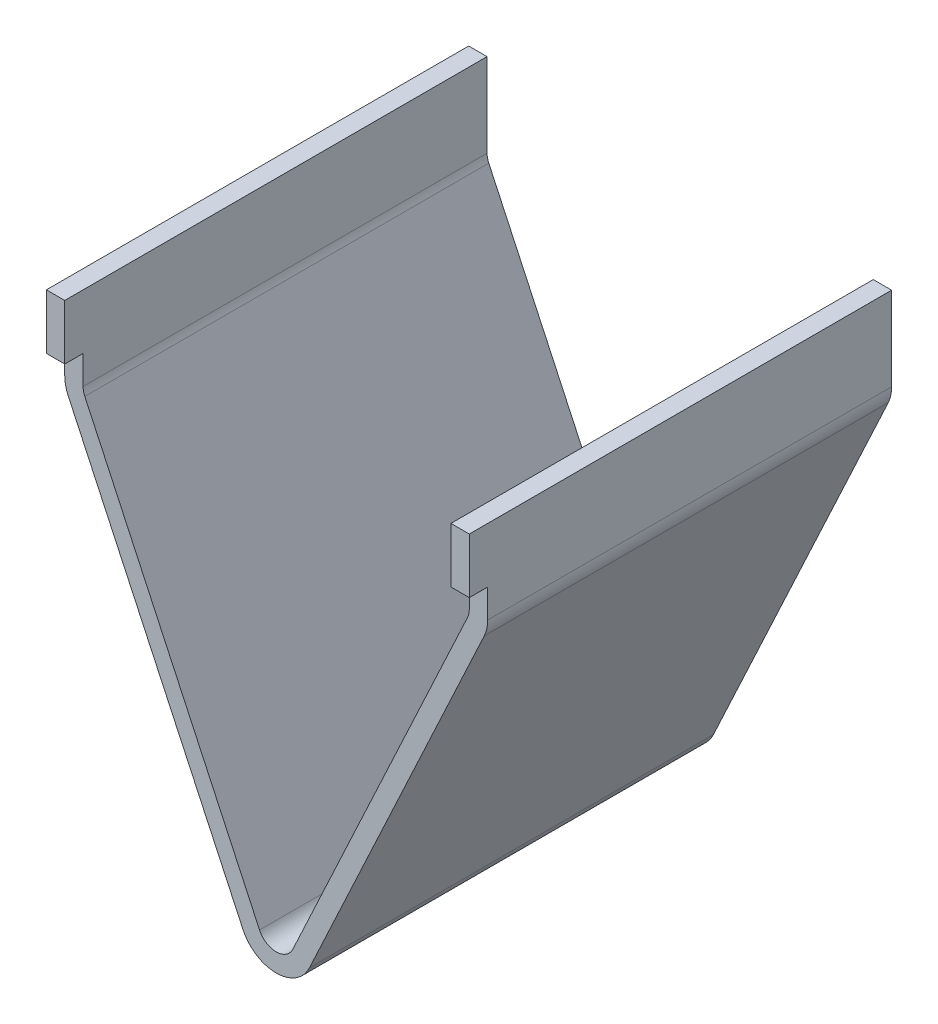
ISO-10303-21;
HEADER;
FILE_DESCRIPTION(('STEP AP214'),'2;1');
FILE_NAME('part.step','',(''),(''),'','','');
FILE_SCHEMA(('AUTOMOTIVE_DESIGN { 1 0 10303 214 1 1 1 1 }'));
ENDSEC;
DATA;
#1=APPLICATION_CONTEXT('core data for automotive mechanical design processes');
#2=APPLICATION_PROTOCOL_DEFINITION('international standard','automotive_design',2000,#1);
#3=PRODUCT_CONTEXT('',#1,'mechanical');
#4=PRODUCT('Part','Part','',(#3));
#5=PRODUCT_RELATED_PRODUCT_CATEGORY('part','',(#4));
#6=PRODUCT_DEFINITION_FORMATION('','',#4);
#7=PRODUCT_DEFINITION_CONTEXT('part definition',#1,'design');
#8=PRODUCT_DEFINITION('design','',#6,#7);
#9=PRODUCT_DEFINITION_SHAPE('','',#8);
#10=(LENGTH_UNIT() NAMED_UNIT(*) SI_UNIT(.MILLI.,.METRE.));
#11=(NAMED_UNIT(*) PLANE_ANGLE_UNIT() SI_UNIT($,.RADIAN.));
#12=(NAMED_UNIT(*) SI_UNIT($,.STERADIAN.) SOLID_ANGLE_UNIT());
#13=UNCERTAINTY_MEASURE_WITH_UNIT(LENGTH_MEASURE(1.E-05),#10,'distance_accuracy_value','');
#14=(GEOMETRIC_REPRESENTATION_CONTEXT(3) GLOBAL_UNCERTAINTY_ASSIGNED_CONTEXT((#13)) GLOBAL_UNIT_ASSIGNED_CONTEXT((#10,
#11,#12)) REPRESENTATION_CONTEXT('',''));
#15=CARTESIAN_POINT('',(0.,0.,0.));
#16=DIRECTION('',(0.,0.,1.));
#17=DIRECTION('',(1.,0.,0.));
#18=AXIS2_PLACEMENT_3D('',#15,#16,#17);
#19=CARTESIAN_POINT('',(2.,0.,0.));
#20=DIRECTION('',(1.,0.,0.));
#21=DIRECTION('',(0.,0.,-1.));
#22=AXIS2_PLACEMENT_3D('',#19,#20,#21);
#23=PLANE('',#22);
#24=DIRECTION('',(0.,0.,-1.));
#25=VECTOR('',#24,1.);
#26=CARTESIAN_POINT('',(2.,-6.,1.));
#27=LINE('',#26,#25);
#28=CARTESIAN_POINT('',(2.,-6.,0.));
#29=VERTEX_POINT('',#28);
#30=CARTESIAN_POINT('',(2.,-6.,2.));
#31=VERTEX_POINT('',#30);
#32=EDGE_CURVE('E258',#29,#31,#27,.F.);
#33=ORIENTED_EDGE('',*,*,#32,.F.);
#34=DIRECTION('',(0.,1.,0.));
#35=VECTOR('',#34,1.);
#36=CARTESIAN_POINT('',(2.,-5.,0.));
#37=LINE('',#36,#35);
#38=CARTESIAN_POINT('',(2.,-9.113221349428,0.));
#39=VERTEX_POINT('',#38);
#40=EDGE_CURVE('E247',#39,#29,#37,.T.);
#41=ORIENTED_EDGE('',*,*,#40,.F.);
#42=DIRECTION('',(0.,0.,1.));
#43=VECTOR('',#42,1.);
#44=CARTESIAN_POINT('',(2.,-9.113221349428,-44.));
#45=LINE('',#44,#43);
#46=CARTESIAN_POINT('',(2.,-9.113221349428,-44.));
#47=VERTEX_POINT('',#46);
#48=EDGE_CURVE('E118',#47,#39,#45,.T.);
#49=ORIENTED_EDGE('',*,*,#48,.F.);
#50=DIRECTION('',(0.,1.,0.));
#51=VECTOR('',#50,1.);
#52=CARTESIAN_POINT('',(2.,-5.,-44.));
#53=LINE('',#52,#51);
#54=CARTESIAN_POINT('',(2.,0.,-44.));
#55=VERTEX_POINT('',#54);
#56=EDGE_CURVE('E251',#55,#47,#53,.F.);
#57=ORIENTED_EDGE('',*,*,#56,.F.);
#58=DIRECTION('',(0.,0.,1.));
#59=VECTOR('',#58,1.);
#60=CARTESIAN_POINT('',(2.,0.,-22.));
#61=LINE('',#60,#59);
#62=CARTESIAN_POINT('',(2.,0.,2.));
#63=VERTEX_POINT('',#62);
#64=EDGE_CURVE('E288',#63,#55,#61,.F.);
#65=ORIENTED_EDGE('',*,*,#64,.F.);
#66=DIRECTION('',(0.,1.,0.));
#67=VECTOR('',#66,1.);
#68=CARTESIAN_POINT('',(2.,-3.,2.));
#69=LINE('',#68,#67);
#70=EDGE_CURVE('E278',#31,#63,#69,.T.);
#71=ORIENTED_EDGE('',*,*,#70,.F.);
#72=EDGE_LOOP('',(#33,#41,#49,#57,#65,#71));
#73=FACE_BOUND('',#72,.T.);
#74=ADVANCED_FACE('F16',(#73),#23,.T.);
#75=CARTESIAN_POINT('',(1.,0.,-22.));
#76=DIRECTION('',(0.,1.,0.));
#77=DIRECTION('',(0.,0.,1.));
#78=AXIS2_PLACEMENT_3D('',#75,#76,#77);
#79=PLANE('',#78);
#80=DIRECTION('',(1.,0.,0.));
#81=VECTOR('',#80,1.);
#82=CARTESIAN_POINT('',(1.,0.,2.));
#83=LINE('',#82,#81);
#84=CARTESIAN_POINT('',(0.,0.,2.));
#85=VERTEX_POINT('',#84);
#86=EDGE_CURVE('E285',#63,#85,#83,.F.);
#87=ORIENTED_EDGE('',*,*,#86,.F.);
#88=ORIENTED_EDGE('',*,*,#64,.T.);
#89=DIRECTION('',(-1.,0.,0.));
#90=VECTOR('',#89,1.);
#91=CARTESIAN_POINT('',(1.,0.,-44.));
#92=LINE('',#91,#90);
#93=CARTESIAN_POINT('',(0.,0.,-44.));
#94=VERTEX_POINT('',#93);
#95=EDGE_CURVE('E255',#94,#55,#92,.F.);
#96=ORIENTED_EDGE('',*,*,#95,.F.);
#97=DIRECTION('',(0.,0.,-1.));
#98=VECTOR('',#97,1.);
#99=CARTESIAN_POINT('',(0.,0.,0.));
#100=LINE('',#99,#98);
#101=EDGE_CURVE('E261',#94,#85,#100,.F.);
#102=ORIENTED_EDGE('',*,*,#101,.T.);
#103=EDGE_LOOP('',(#87,#88,#96,#102));
#104=FACE_BOUND('',#103,.T.);
#105=ADVANCED_FACE('F461',(#104),#79,.T.);
#106=CARTESIAN_POINT('',(1.,-3.,2.));
#107=DIRECTION('',(0.,0.,1.));
#108=DIRECTION('',(1.,0.,0.));
#109=AXIS2_PLACEMENT_3D('',#106,#107,#108);
#110=PLANE('',#109);
#111=DIRECTION('',(1.,0.,0.));
#112=VECTOR('',#111,1.);
#113=CARTESIAN_POINT('',(1.,-6.,2.));
#114=LINE('',#113,#112);
#115=CARTESIAN_POINT('',(0.,-6.,2.));
#116=VERTEX_POINT('',#115);
#117=EDGE_CURVE('E275',#31,#116,#114,.F.);
#118=ORIENTED_EDGE('',*,*,#117,.F.);
#119=ORIENTED_EDGE('',*,*,#70,.T.);
#120=ORIENTED_EDGE('',*,*,#86,.T.);
#121=DIRECTION('',(0.,1.,0.));
#122=VECTOR('',#121,1.);
#123=CARTESIAN_POINT('',(0.,0.,2.));
#124=LINE('',#123,#122);
#125=EDGE_CURVE('E264',#85,#116,#124,.F.);
#126=ORIENTED_EDGE('',*,*,#125,.T.);
#127=EDGE_LOOP('',(#118,#119,#120,#126));
#128=FACE_BOUND('',#127,.T.);
#129=ADVANCED_FACE('F458',(#128),#110,.T.);
#130=CARTESIAN_POINT('',(1.,-6.,1.));
#131=DIRECTION('',(0.,-1.,0.));
#132=DIRECTION('',(0.,0.,-1.));
#133=AXIS2_PLACEMENT_3D('',#130,#131,#132);
#134=PLANE('',#133);
#135=DIRECTION('',(1.,0.,0.));
#136=VECTOR('',#135,1.);
#137=CARTESIAN_POINT('',(1.,-6.,0.));
#138=LINE('',#137,#136);
#139=CARTESIAN_POINT('',(0.,-6.,0.));
#140=VERTEX_POINT('',#139);
#141=EDGE_CURVE('E250',#29,#140,#138,.F.);
#142=ORIENTED_EDGE('',*,*,#141,.F.);
#143=ORIENTED_EDGE('',*,*,#32,.T.);
#144=ORIENTED_EDGE('',*,*,#117,.T.);
#145=DIRECTION('',(0.,0.,-1.));
#146=VECTOR('',#145,1.);
#147=CARTESIAN_POINT('',(0.,-6.,0.));
#148=LINE('',#147,#146);
#149=EDGE_CURVE('E229',#116,#140,#148,.T.);
#150=ORIENTED_EDGE('',*,*,#149,.T.);
#151=EDGE_LOOP('',(#142,#143,#144,#150));
#152=FACE_BOUND('',#151,.T.);
#153=ADVANCED_FACE('F455',(#152),#134,.T.);
#154=CARTESIAN_POINT('',(-2.,-9.113221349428,-44.));
#155=DIRECTION('',(0.,0.,1.));
#156=DIRECTION('',(1.,0.,0.));
#157=AXIS2_PLACEMENT_3D('',#154,#155,#156);
#158=CYLINDRICAL_SURFACE('',#157,4.);
#159=CARTESIAN_POINT('',(-2.,-9.113221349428,0.));
#160=DIRECTION('',(0.,0.,1.));
#161=DIRECTION('',(1.,0.,0.));
#162=AXIS2_PLACEMENT_3D('',#159,#160,#161);
#163=CIRCLE('',#162,4.);
#164=CARTESIAN_POINT('',(1.62523114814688,-10.8036943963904,0.));
#165=VERTEX_POINT('',#164);
#166=EDGE_CURVE('E224',#39,#165,#163,.F.);
#167=ORIENTED_EDGE('',*,*,#166,.T.);
#168=DIRECTION('',(0.,0.,1.));
#169=VECTOR('',#168,1.);
#170=CARTESIAN_POINT('',(1.62523114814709,-10.80369439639,0.));
#171=LINE('',#170,#169);
#172=CARTESIAN_POINT('',(1.62523114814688,-10.8036943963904,-44.));
#173=VERTEX_POINT('',#172);
#174=EDGE_CURVE('E220',#173,#165,#171,.T.);
#175=ORIENTED_EDGE('',*,*,#174,.F.);
#176=CARTESIAN_POINT('',(-2.,-9.113221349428,-44.));
#177=DIRECTION('',(0.,0.,1.));
#178=DIRECTION('',(1.,0.,0.));
#179=AXIS2_PLACEMENT_3D('',#176,#177,#178);
#180=CIRCLE('',#179,4.);
#181=EDGE_CURVE('E117',#47,#173,#180,.F.);
#182=ORIENTED_EDGE('',*,*,#181,.F.);
#183=ORIENTED_EDGE('',*,*,#48,.T.);
#184=EDGE_LOOP('',(#167,#175,#182,#183));
#185=FACE_BOUND('',#184,.T.);
#186=ADVANCED_FACE('F329',(#185),#158,.T.);
#187=CARTESIAN_POINT('',(-44.06539052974,-10.,0.));
#188=DIRECTION('',(-1.,0.,0.));
#189=DIRECTION('',(0.,0.,1.));
#190=AXIS2_PLACEMENT_3D('',#187,#188,#189);
#191=PLANE('',#190);
#192=DIRECTION('',(0.,1.,0.));
#193=VECTOR('',#192,1.);
#194=CARTESIAN_POINT('',(-44.06539052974,-3.,2.));
#195=LINE('',#194,#193);
#196=CARTESIAN_POINT('',(-44.06539052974,0.,2.));
#197=VERTEX_POINT('',#196);
#198=CARTESIAN_POINT('',(-44.06539052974,-6.,2.));
#199=VERTEX_POINT('',#198);
#200=EDGE_CURVE('E205',#197,#199,#195,.F.);
#201=ORIENTED_EDGE('',*,*,#200,.F.);
#202=DIRECTION('',(0.,0.,1.));
#203=VECTOR('',#202,1.);
#204=CARTESIAN_POINT('',(-44.06539052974,0.,-22.));
#205=LINE('',#204,#203);
#206=CARTESIAN_POINT('',(-44.06539052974,0.,-44.));
#207=VERTEX_POINT('',#206);
#208=EDGE_CURVE('E195',#207,#197,#205,.T.);
#209=ORIENTED_EDGE('',*,*,#208,.F.);
#210=DIRECTION('',(0.,1.,0.));
#211=VECTOR('',#210,1.);
#212=CARTESIAN_POINT('',(-44.06539052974,-4.556610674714,-44.));
#213=LINE('',#212,#211);
#214=CARTESIAN_POINT('',(-44.06539052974,-9.113221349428,-44.));
#215=VERTEX_POINT('',#214);
#216=EDGE_CURVE('E177',#215,#207,#213,.T.);
#217=ORIENTED_EDGE('',*,*,#216,.F.);
#218=DIRECTION('',(0.,0.,1.));
#219=VECTOR('',#218,1.);
#220=CARTESIAN_POINT('',(-44.06539052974,-9.113221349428,-44.));
#221=LINE('',#220,#219);
#222=CARTESIAN_POINT('',(-44.06539052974,-9.113221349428,0.));
#223=VERTEX_POINT('',#222);
#224=EDGE_CURVE('E175',#223,#215,#221,.F.);
#225=ORIENTED_EDGE('',*,*,#224,.F.);
#226=DIRECTION('',(0.,1.,0.));
#227=VECTOR('',#226,1.);
#228=CARTESIAN_POINT('',(-44.06539052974,-4.556610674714,0.));
#229=LINE('',#228,#227);
#230=CARTESIAN_POINT('',(-44.06539052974,-6.,0.));
#231=VERTEX_POINT('',#230);
#232=EDGE_CURVE('E216',#231,#223,#229,.F.);
#233=ORIENTED_EDGE('',*,*,#232,.F.);
#234=DIRECTION('',(0.,0.,-1.));
#235=VECTOR('',#234,1.);
#236=CARTESIAN_POINT('',(-44.06539052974,-6.,1.));
#237=LINE('',#236,#235);
#238=EDGE_CURVE('E206',#199,#231,#237,.T.);
#239=ORIENTED_EDGE('',*,*,#238,.F.);
#240=EDGE_LOOP('',(#201,#209,#217,#225,#233,#239));
#241=FACE_BOUND('',#240,.T.);
#242=ADVANCED_FACE('F353',(#241),#191,.T.);
#243=CARTESIAN_POINT('',(0.,0.,0.));
#244=DIRECTION('',(1.,0.,0.));
#245=DIRECTION('',(0.,0.,-1.));
#246=AXIS2_PLACEMENT_3D('',#243,#244,#245);
#247=PLANE('',#246);
#248=DIRECTION('',(0.,0.,1.));
#249=VECTOR('',#248,1.);
#250=CARTESIAN_POINT('',(0.,-9.113221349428,-44.));
#251=LINE('',#250,#249);
#252=CARTESIAN_POINT('',(0.,-9.113221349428,-44.));
#253=VERTEX_POINT('',#252);
#254=CARTESIAN_POINT('',(0.,-9.113221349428,0.));
#255=VERTEX_POINT('',#254);
#256=EDGE_CURVE('E112',#253,#255,#251,.T.);
#257=ORIENTED_EDGE('',*,*,#256,.T.);
#258=DIRECTION('',(0.,1.,0.));
#259=VECTOR('',#258,1.);
#260=CARTESIAN_POINT('',(0.,0.,0.));
#261=LINE('',#260,#259);
#262=EDGE_CURVE('E226',#140,#255,#261,.F.);
#263=ORIENTED_EDGE('',*,*,#262,.F.);
#264=ORIENTED_EDGE('',*,*,#149,.F.);
#265=ORIENTED_EDGE('',*,*,#125,.F.);
#266=ORIENTED_EDGE('',*,*,#101,.F.);
#267=DIRECTION('',(0.,1.,0.));
#268=VECTOR('',#267,1.);
#269=CARTESIAN_POINT('',(0.,0.,-44.));
#270=LINE('',#269,#268);
#271=EDGE_CURVE('E228',#253,#94,#270,.T.);
#272=ORIENTED_EDGE('',*,*,#271,.F.);
#273=EDGE_LOOP('',(#257,#263,#264,#265,#266,#272));
#274=FACE_BOUND('',#273,.T.);
#275=ADVANCED_FACE('F447',(#274),#247,.F.);
#276=CARTESIAN_POINT('',(2.,-10.,0.));
#277=DIRECTION('',(0.906307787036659,-0.422618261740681,0.));
#278=DIRECTION('',(0.422618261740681,0.906307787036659,0.));
#279=AXIS2_PLACEMENT_3D('',#276,#277,#278);
#280=PLANE('',#279);
#281=ORIENTED_EDGE('',*,*,#174,.T.);
#282=DIRECTION('',(0.422618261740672,0.906307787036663,0.));
#283=VECTOR('',#282,1.);
#284=CARTESIAN_POINT('',(-17.40746411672,-51.61944110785,0.));
#285=LINE('',#284,#283);
#286=CARTESIAN_POINT('',(-17.4074641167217,-51.6194411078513,0.));
#287=VERTEX_POINT('',#286);
#288=EDGE_CURVE('E166',#287,#165,#285,.T.);
#289=ORIENTED_EDGE('',*,*,#288,.F.);
#290=DIRECTION('',(0.,0.,1.));
#291=VECTOR('',#290,1.);
#292=CARTESIAN_POINT('',(-17.4074641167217,-51.6194411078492,-44.));
#293=LINE('',#292,#291);
#294=CARTESIAN_POINT('',(-17.4074641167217,-51.6194411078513,-44.));
#295=VERTEX_POINT('',#294);
#296=EDGE_CURVE('E170',#295,#287,#293,.T.);
#297=ORIENTED_EDGE('',*,*,#296,.F.);
#298=DIRECTION('',(-0.422618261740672,-0.906307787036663,0.));
#299=VECTOR('',#298,1.);
#300=CARTESIAN_POINT('',(1.625231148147,-10.80369439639,-44.));
#301=LINE('',#300,#299);
#302=EDGE_CURVE('E173',#173,#295,#301,.T.);
#303=ORIENTED_EDGE('',*,*,#302,.F.);
#304=EDGE_LOOP('',(#281,#289,#297,#303));
#305=FACE_BOUND('',#304,.T.);
#306=ADVANCED_FACE('F333',(#305),#280,.T.);
#307=CARTESIAN_POINT('',(-43.06539052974,-6.,1.));
#308=DIRECTION('',(0.,-1.,0.));
#309=DIRECTION('',(0.,0.,-1.));
#310=AXIS2_PLACEMENT_3D('',#307,#308,#309);
#311=PLANE('',#310);
#312=DIRECTION('',(1.,0.,0.));
#313=VECTOR('',#312,1.);
#314=CARTESIAN_POINT('',(-43.06539052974,-6.,2.));
#315=LINE('',#314,#313);
#316=CARTESIAN_POINT('',(-42.06539052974,-6.,2.));
#317=VERTEX_POINT('',#316);
#318=EDGE_CURVE('E202',#199,#317,#315,.T.);
#319=ORIENTED_EDGE('',*,*,#318,.F.);
#320=ORIENTED_EDGE('',*,*,#238,.T.);
#321=DIRECTION('',(1.,0.,0.));
#322=VECTOR('',#321,1.);
#323=CARTESIAN_POINT('',(-43.06539052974,-6.,0.));
#324=LINE('',#323,#322);
#325=CARTESIAN_POINT('',(-42.06539052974,-6.,0.));
#326=VERTEX_POINT('',#325);
#327=EDGE_CURVE('E213',#231,#326,#324,.T.);
#328=ORIENTED_EDGE('',*,*,#327,.T.);
#329=DIRECTION('',(0.,0.,1.));
#330=VECTOR('',#329,1.);
#331=CARTESIAN_POINT('',(-42.06539052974,-6.,0.));
#332=LINE('',#331,#330);
#333=EDGE_CURVE('E160',#326,#317,#332,.T.);
#334=ORIENTED_EDGE('',*,*,#333,.T.);
#335=EDGE_LOOP('',(#319,#320,#328,#334));
#336=FACE_BOUND('',#335,.T.);
#337=ADVANCED_FACE('F376',(#336),#311,.T.);
#338=CARTESIAN_POINT('',(-43.06539052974,-3.,2.));
#339=DIRECTION('',(0.,0.,1.));
#340=DIRECTION('',(1.,0.,0.));
#341=AXIS2_PLACEMENT_3D('',#338,#339,#340);
#342=PLANE('',#341);
#343=DIRECTION('',(1.,0.,0.));
#344=VECTOR('',#343,1.);
#345=CARTESIAN_POINT('',(-43.06539052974,0.,2.));
#346=LINE('',#345,#344);
#347=CARTESIAN_POINT('',(-42.06539052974,0.,2.));
#348=VERTEX_POINT('',#347);
#349=EDGE_CURVE('E185',#197,#348,#346,.T.);
#350=ORIENTED_EDGE('',*,*,#349,.F.);
#351=ORIENTED_EDGE('',*,*,#200,.T.);
#352=ORIENTED_EDGE('',*,*,#318,.T.);
#353=DIRECTION('',(0.,1.,0.));
#354=VECTOR('',#353,1.);
#355=CARTESIAN_POINT('',(-42.06539052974,-10.,2.));
#356=LINE('',#355,#354);
#357=EDGE_CURVE('E190',#317,#348,#356,.T.);
#358=ORIENTED_EDGE('',*,*,#357,.T.);
#359=EDGE_LOOP('',(#350,#351,#352,#358));
#360=FACE_BOUND('',#359,.T.);
#361=ADVANCED_FACE('F371',(#360),#342,.T.);
#362=CARTESIAN_POINT('',(-43.06539052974,0.,-22.));
#363=DIRECTION('',(0.,1.,0.));
#364=DIRECTION('',(0.,0.,1.));
#365=AXIS2_PLACEMENT_3D('',#362,#363,#364);
#366=PLANE('',#365);
#367=ORIENTED_EDGE('',*,*,#349,.T.);
#368=DIRECTION('',(0.,0.,1.));
#369=VECTOR('',#368,1.);
#370=CARTESIAN_POINT('',(-42.06539052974,0.,0.));
#371=LINE('',#370,#369);
#372=CARTESIAN_POINT('',(-42.06539052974,0.,-44.));
#373=VERTEX_POINT('',#372);
#374=EDGE_CURVE('E154',#348,#373,#371,.F.);
#375=ORIENTED_EDGE('',*,*,#374,.T.);
#376=DIRECTION('',(-1.,0.,0.));
#377=VECTOR('',#376,1.);
#378=CARTESIAN_POINT('',(-43.06539052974,0.,-44.));
#379=LINE('',#378,#377);
#380=EDGE_CURVE('E180',#207,#373,#379,.F.);
#381=ORIENTED_EDGE('',*,*,#380,.F.);
#382=ORIENTED_EDGE('',*,*,#208,.T.);
#383=EDGE_LOOP('',(#367,#375,#381,#382));
#384=FACE_BOUND('',#383,.T.);
#385=ADVANCED_FACE('F359',(#384),#366,.T.);
#386=CARTESIAN_POINT('',(-40.06539052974,-9.113221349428,-44.));
#387=DIRECTION('',(0.,0.,1.));
#388=DIRECTION('',(1.,0.,0.));
#389=AXIS2_PLACEMENT_3D('',#386,#387,#388);
#390=CYLINDRICAL_SURFACE('',#389,4.);
#391=CARTESIAN_POINT('',(-40.06539052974,-9.113221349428,0.));
#392=DIRECTION('',(0.,0.,1.));
#393=DIRECTION('',(1.,0.,0.));
#394=AXIS2_PLACEMENT_3D('',#391,#392,#393);
#395=CIRCLE('',#394,4.);
#396=CARTESIAN_POINT('',(-43.6906216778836,-10.8036943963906,0.));
#397=VERTEX_POINT('',#396);
#398=EDGE_CURVE('E169',#397,#223,#395,.F.);
#399=ORIENTED_EDGE('',*,*,#398,.T.);
#400=ORIENTED_EDGE('',*,*,#224,.T.);
#401=CARTESIAN_POINT('',(-40.06539052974,-9.113221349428,-44.));
#402=DIRECTION('',(0.,0.,1.));
#403=DIRECTION('',(1.,0.,0.));
#404=AXIS2_PLACEMENT_3D('',#401,#402,#403);
#405=CIRCLE('',#404,4.);
#406=CARTESIAN_POINT('',(-43.6906216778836,-10.8036943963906,-44.));
#407=VERTEX_POINT('',#406);
#408=EDGE_CURVE('E144',#407,#215,#405,.F.);
#409=ORIENTED_EDGE('',*,*,#408,.F.);
#410=DIRECTION('',(0.,0.,1.));
#411=VECTOR('',#410,1.);
#412=CARTESIAN_POINT('',(-43.6906216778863,-10.8036943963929,0.));
#413=LINE('',#412,#411);
#414=EDGE_CURVE('E138',#397,#407,#413,.F.);
#415=ORIENTED_EDGE('',*,*,#414,.F.);
#416=EDGE_LOOP('',(#399,#400,#409,#415));
#417=FACE_BOUND('',#416,.T.);
#418=ADVANCED_FACE('F346',(#417),#390,.T.);
#419=CARTESIAN_POINT('',(-2.,-9.113221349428,-44.));
#420=DIRECTION('',(0.,0.,1.));
#421=DIRECTION('',(1.,0.,0.));
#422=AXIS2_PLACEMENT_3D('',#419,#420,#421);
#423=CYLINDRICAL_SURFACE('',#422,2.);
#424=ORIENTED_EDGE('',*,*,#256,.F.);
#425=CARTESIAN_POINT('',(-2.,-9.113221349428,-44.));
#426=DIRECTION('',(0.,0.,1.));
#427=DIRECTION('',(1.,0.,0.));
#428=AXIS2_PLACEMENT_3D('',#425,#426,#427);
#429=CIRCLE('',#428,2.);
#430=CARTESIAN_POINT('',(-0.187384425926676,-9.95845787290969,-44.));
#431=VERTEX_POINT('',#430);
#432=EDGE_CURVE('E19',#431,#253,#429,.T.);
#433=ORIENTED_EDGE('',*,*,#432,.F.);
#434=DIRECTION('',(0.,0.,1.));
#435=VECTOR('',#434,1.);
#436=CARTESIAN_POINT('',(-0.187384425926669,-9.95845787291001,0.));
#437=LINE('',#436,#435);
#438=CARTESIAN_POINT('',(-0.187384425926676,-9.95845787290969,0.));
#439=VERTEX_POINT('',#438);
#440=EDGE_CURVE('E110',#431,#439,#437,.T.);
#441=ORIENTED_EDGE('',*,*,#440,.T.);
#442=CARTESIAN_POINT('',(-2.,-9.113221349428,0.));
#443=DIRECTION('',(0.,0.,1.));
#444=DIRECTION('',(1.,0.,0.));
#445=AXIS2_PLACEMENT_3D('',#442,#443,#444);
#446=CIRCLE('',#445,2.);
#447=EDGE_CURVE('E171',#255,#439,#446,.F.);
#448=ORIENTED_EDGE('',*,*,#447,.F.);
#449=EDGE_LOOP('',(#424,#433,#441,#448));
#450=FACE_BOUND('',#449,.T.);
#451=ADVANCED_FACE('F108',(#450),#423,.F.);
#452=CARTESIAN_POINT('',(-21.03269526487,-49.92896806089,-44.));
#453=DIRECTION('',(0.,0.,1.));
#454=DIRECTION('',(1.,0.,0.));
#455=AXIS2_PLACEMENT_3D('',#452,#453,#454);
#456=CYLINDRICAL_SURFACE('',#455,4.);
#457=CARTESIAN_POINT('',(-21.03269526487,-49.92896806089,0.));
#458=DIRECTION('',(0.,0.,1.));
#459=DIRECTION('',(1.,0.,0.));
#460=AXIS2_PLACEMENT_3D('',#457,#458,#459);
#461=CIRCLE('',#460,4.);
#462=CARTESIAN_POINT('',(-24.6579264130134,-51.6194411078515,0.));
#463=VERTEX_POINT('',#462);
#464=EDGE_CURVE('E126',#287,#463,#461,.F.);
#465=ORIENTED_EDGE('',*,*,#464,.T.);
#466=DIRECTION('',(0.,0.,1.));
#467=VECTOR('',#466,1.);
#468=CARTESIAN_POINT('',(-24.6579264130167,-51.6194411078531,0.));
#469=LINE('',#468,#467);
#470=CARTESIAN_POINT('',(-24.6579264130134,-51.6194411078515,-44.));
#471=VERTEX_POINT('',#470);
#472=EDGE_CURVE('E136',#471,#463,#469,.T.);
#473=ORIENTED_EDGE('',*,*,#472,.F.);
#474=CARTESIAN_POINT('',(-21.03269526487,-49.92896806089,-44.));
#475=DIRECTION('',(0.,0.,1.));
#476=DIRECTION('',(1.,0.,0.));
#477=AXIS2_PLACEMENT_3D('',#474,#475,#476);
#478=CIRCLE('',#477,4.);
#479=EDGE_CURVE('E131',#295,#471,#478,.F.);
#480=ORIENTED_EDGE('',*,*,#479,.F.);
#481=ORIENTED_EDGE('',*,*,#296,.T.);
#482=EDGE_LOOP('',(#465,#473,#480,#481));
#483=FACE_BOUND('',#482,.T.);
#484=ADVANCED_FACE('F338',(#483),#456,.T.);
#485=CARTESIAN_POINT('',(-42.06539052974,-10.,0.));
#486=DIRECTION('',(-1.,0.,0.));
#487=DIRECTION('',(0.,0.,1.));
#488=AXIS2_PLACEMENT_3D('',#485,#486,#487);
#489=PLANE('',#488);
#490=DIRECTION('',(0.,1.,0.));
#491=VECTOR('',#490,1.);
#492=CARTESIAN_POINT('',(-42.06539052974,-10.,-44.));
#493=LINE('',#492,#491);
#494=CARTESIAN_POINT('',(-42.06539052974,-9.113221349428,-44.));
#495=VERTEX_POINT('',#494);
#496=EDGE_CURVE('E152',#373,#495,#493,.F.);
#497=ORIENTED_EDGE('',*,*,#496,.F.);
#498=ORIENTED_EDGE('',*,*,#374,.F.);
#499=ORIENTED_EDGE('',*,*,#357,.F.);
#500=ORIENTED_EDGE('',*,*,#333,.F.);
#501=DIRECTION('',(0.,1.,0.));
#502=VECTOR('',#501,1.);
#503=CARTESIAN_POINT('',(-42.06539052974,-10.,0.));
#504=LINE('',#503,#502);
#505=CARTESIAN_POINT('',(-42.06539052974,-9.113221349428,0.));
#506=VERTEX_POINT('',#505);
#507=EDGE_CURVE('E157',#506,#326,#504,.T.);
#508=ORIENTED_EDGE('',*,*,#507,.F.);
#509=DIRECTION('',(0.,0.,1.));
#510=VECTOR('',#509,1.);
#511=CARTESIAN_POINT('',(-42.06539052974,-9.113221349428,-44.));
#512=LINE('',#511,#510);
#513=EDGE_CURVE('E148',#506,#495,#512,.F.);
#514=ORIENTED_EDGE('',*,*,#513,.T.);
#515=EDGE_LOOP('',(#497,#498,#499,#500,#508,#514));
#516=FACE_BOUND('',#515,.T.);
#517=ADVANCED_FACE('F366',(#516),#489,.F.);
#518=CARTESIAN_POINT('',(-21.03269526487,-59.3937743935,0.));
#519=DIRECTION('',(-0.906307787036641,-0.422618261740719,0.));
#520=DIRECTION('',(0.422618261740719,-0.906307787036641,0.));
#521=AXIS2_PLACEMENT_3D('',#518,#519,#520);
#522=PLANE('',#521);
#523=ORIENTED_EDGE('',*,*,#472,.T.);
#524=DIRECTION('',(0.422618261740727,-0.906307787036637,0.));
#525=VECTOR('',#524,1.);
#526=CARTESIAN_POINT('',(-43.69062167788,-10.80369439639,0.));
#527=LINE('',#526,#525);
#528=EDGE_CURVE('E151',#397,#463,#527,.T.);
#529=ORIENTED_EDGE('',*,*,#528,.F.);
#530=ORIENTED_EDGE('',*,*,#414,.T.);
#531=DIRECTION('',(-0.422618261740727,0.906307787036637,0.));
#532=VECTOR('',#531,1.);
#533=CARTESIAN_POINT('',(-24.65792641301,-51.61944110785,-44.));
#534=LINE('',#533,#532);
#535=EDGE_CURVE('E139',#471,#407,#534,.T.);
#536=ORIENTED_EDGE('',*,*,#535,.F.);
#537=EDGE_LOOP('',(#523,#529,#530,#536));
#538=FACE_BOUND('',#537,.T.);
#539=ADVANCED_FACE('F342',(#538),#522,.T.);
#540=CARTESIAN_POINT('',(0.1873844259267,-9.154763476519,0.));
#541=DIRECTION('',(0.906307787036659,-0.422618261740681,0.));
#542=DIRECTION('',(0.422618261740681,0.906307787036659,0.));
#543=AXIS2_PLACEMENT_3D('',#540,#541,#542);
#544=PLANE('',#543);
#545=DIRECTION('',(0.422618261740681,0.906307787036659,0.));
#546=VECTOR('',#545,1.);
#547=CARTESIAN_POINT('',(0.1873844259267,-9.154763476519,-44.));
#548=LINE('',#547,#546);
#549=CARTESIAN_POINT('',(-19.220079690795,-50.7742045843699,-44.));
#550=VERTEX_POINT('',#549);
#551=EDGE_CURVE('E122',#550,#431,#548,.T.);
#552=ORIENTED_EDGE('',*,*,#551,.F.);
#553=DIRECTION('',(0.,0.,1.));
#554=VECTOR('',#553,1.);
#555=CARTESIAN_POINT('',(-19.220079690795,-50.7742045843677,-44.));
#556=LINE('',#555,#554);
#557=CARTESIAN_POINT('',(-19.220079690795,-50.7742045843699,0.));
#558=VERTEX_POINT('',#557);
#559=EDGE_CURVE('E309',#550,#558,#556,.T.);
#560=ORIENTED_EDGE('',*,*,#559,.T.);
#561=DIRECTION('',(0.422618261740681,0.906307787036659,0.));
#562=VECTOR('',#561,1.);
#563=CARTESIAN_POINT('',(0.1873844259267,-9.154763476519,0.));
#564=LINE('',#563,#562);
#565=EDGE_CURVE('E124',#439,#558,#564,.F.);
#566=ORIENTED_EDGE('',*,*,#565,.F.);
#567=ORIENTED_EDGE('',*,*,#440,.F.);
#568=EDGE_LOOP('',(#552,#560,#566,#567));
#569=FACE_BOUND('',#568,.T.);
#570=ADVANCED_FACE('F120',(#569),#544,.F.);
#571=CARTESIAN_POINT('',(-33.45535068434,-30.38710229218,0.));
#572=DIRECTION('',(0.,0.,1.));
#573=DIRECTION('',(1.,0.,0.));
#574=AXIS2_PLACEMENT_3D('',#571,#572,#573);
#575=PLANE('',#574);
#576=DIRECTION('',(0.422618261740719,-0.906307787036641,0.));
#577=VECTOR('',#576,1.);
#578=CARTESIAN_POINT('',(-19.22007969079,-58.54853787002,0.));
#579=LINE('',#578,#577);
#580=CARTESIAN_POINT('',(-22.8453108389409,-50.7742045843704,0.));
#581=VERTEX_POINT('',#580);
#582=CARTESIAN_POINT('',(-41.8780061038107,-9.95845787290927,0.));
#583=VERTEX_POINT('',#582);
#584=EDGE_CURVE('E147',#581,#583,#579,.F.);
#585=ORIENTED_EDGE('',*,*,#584,.T.);
#586=CARTESIAN_POINT('',(-40.06539052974,-9.113221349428,0.));
#587=DIRECTION('',(0.,0.,1.));
#588=DIRECTION('',(1.,0.,0.));
#589=AXIS2_PLACEMENT_3D('',#586,#587,#588);
#590=CIRCLE('',#589,2.);
#591=EDGE_CURVE('E161',#506,#583,#590,.T.);
#592=ORIENTED_EDGE('',*,*,#591,.F.);
#593=ORIENTED_EDGE('',*,*,#507,.T.);
#594=ORIENTED_EDGE('',*,*,#327,.F.);
#595=ORIENTED_EDGE('',*,*,#232,.T.);
#596=ORIENTED_EDGE('',*,*,#398,.F.);
#597=ORIENTED_EDGE('',*,*,#528,.T.);
#598=ORIENTED_EDGE('',*,*,#464,.F.);
#599=ORIENTED_EDGE('',*,*,#288,.T.);
#600=ORIENTED_EDGE('',*,*,#166,.F.);
#601=ORIENTED_EDGE('',*,*,#40,.T.);
#602=ORIENTED_EDGE('',*,*,#141,.T.);
#603=ORIENTED_EDGE('',*,*,#262,.T.);
#604=ORIENTED_EDGE('',*,*,#447,.T.);
#605=ORIENTED_EDGE('',*,*,#565,.T.);
#606=CARTESIAN_POINT('',(-21.03269526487,-49.92896806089,0.));
#607=DIRECTION('',(0.,0.,1.));
#608=DIRECTION('',(1.,0.,0.));
#609=AXIS2_PLACEMENT_3D('',#606,#607,#608);
#610=CIRCLE('',#609,2.);
#611=EDGE_CURVE('E306',#558,#581,#610,.F.);
#612=ORIENTED_EDGE('',*,*,#611,.T.);
#613=EDGE_LOOP('',(#585,#592,#593,#594,#595,#596,#597,#598,#599,#600,#601,#602,#603,#604,#605,#612));
#614=FACE_BOUND('',#613,.T.);
#615=ADVANCED_FACE('F409',(#614),#575,.T.);
#616=CARTESIAN_POINT('',(-40.06539052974,-9.113221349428,-44.));
#617=DIRECTION('',(0.,0.,1.));
#618=DIRECTION('',(1.,0.,0.));
#619=AXIS2_PLACEMENT_3D('',#616,#617,#618);
#620=CYLINDRICAL_SURFACE('',#619,2.);
#621=DIRECTION('',(0.,0.,1.));
#622=VECTOR('',#621,1.);
#623=CARTESIAN_POINT('',(-41.8780061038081,-9.9584578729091,0.));
#624=LINE('',#623,#622);
#625=CARTESIAN_POINT('',(-41.8780061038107,-9.95845787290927,-44.));
#626=VERTEX_POINT('',#625);
#627=EDGE_CURVE('E135',#583,#626,#624,.F.);
#628=ORIENTED_EDGE('',*,*,#627,.T.);
#629=CARTESIAN_POINT('',(-40.06539052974,-9.113221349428,-44.));
#630=DIRECTION('',(0.,0.,1.));
#631=DIRECTION('',(1.,0.,0.));
#632=AXIS2_PLACEMENT_3D('',#629,#630,#631);
#633=CIRCLE('',#632,2.);
#634=EDGE_CURVE('E142',#495,#626,#633,.T.);
#635=ORIENTED_EDGE('',*,*,#634,.F.);
#636=ORIENTED_EDGE('',*,*,#513,.F.);
#637=ORIENTED_EDGE('',*,*,#591,.T.);
#638=EDGE_LOOP('',(#628,#635,#636,#637));
#639=FACE_BOUND('',#638,.T.);
#640=ADVANCED_FACE('F419',(#639),#620,.F.);
#641=CARTESIAN_POINT('',(-33.45535068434,-30.38710229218,-44.));
#642=DIRECTION('',(0.,0.,-1.));
#643=DIRECTION('',(-1.,0.,0.));
#644=AXIS2_PLACEMENT_3D('',#641,#642,#643);
#645=PLANE('',#644);
#646=DIRECTION('',(0.422618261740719,-0.906307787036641,0.));
#647=VECTOR('',#646,1.);
#648=CARTESIAN_POINT('',(-19.22007969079,-58.54853787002,-44.));
#649=LINE('',#648,#647);
#650=CARTESIAN_POINT('',(-22.8453108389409,-50.7742045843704,-44.));
#651=VERTEX_POINT('',#650);
#652=EDGE_CURVE('E25',#626,#651,#649,.T.);
#653=ORIENTED_EDGE('',*,*,#652,.T.);
#654=CARTESIAN_POINT('',(-21.03269526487,-49.92896806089,-44.));
#655=DIRECTION('',(0.,0.,1.));
#656=DIRECTION('',(1.,0.,0.));
#657=AXIS2_PLACEMENT_3D('',#654,#655,#656);
#658=CIRCLE('',#657,2.);
#659=EDGE_CURVE('E33',#651,#550,#658,.T.);
#660=ORIENTED_EDGE('',*,*,#659,.T.);
#661=ORIENTED_EDGE('',*,*,#551,.T.);
#662=ORIENTED_EDGE('',*,*,#432,.T.);
#663=ORIENTED_EDGE('',*,*,#271,.T.);
#664=ORIENTED_EDGE('',*,*,#95,.T.);
#665=ORIENTED_EDGE('',*,*,#56,.T.);
#666=ORIENTED_EDGE('',*,*,#181,.T.);
#667=ORIENTED_EDGE('',*,*,#302,.T.);
#668=ORIENTED_EDGE('',*,*,#479,.T.);
#669=ORIENTED_EDGE('',*,*,#535,.T.);
#670=ORIENTED_EDGE('',*,*,#408,.T.);
#671=ORIENTED_EDGE('',*,*,#216,.T.);
#672=ORIENTED_EDGE('',*,*,#380,.T.);
#673=ORIENTED_EDGE('',*,*,#496,.T.);
#674=ORIENTED_EDGE('',*,*,#634,.T.);
#675=EDGE_LOOP('',(#653,#660,#661,#662,#663,#664,#665,#666,#667,#668,#669,#670,#671,#672,#673,#674));
#676=FACE_BOUND('',#675,.T.);
#677=ADVANCED_FACE('F129',(#676),#645,.T.);
#678=CARTESIAN_POINT('',(-21.03269526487,-49.92896806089,-44.));
#679=DIRECTION('',(0.,0.,1.));
#680=DIRECTION('',(1.,0.,0.));
#681=AXIS2_PLACEMENT_3D('',#678,#679,#680);
#682=CYLINDRICAL_SURFACE('',#681,2.);
#683=ORIENTED_EDGE('',*,*,#559,.F.);
#684=ORIENTED_EDGE('',*,*,#659,.F.);
#685=DIRECTION('',(0.,0.,1.));
#686=VECTOR('',#685,1.);
#687=CARTESIAN_POINT('',(-22.8453108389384,-50.7742045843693,0.));
#688=LINE('',#687,#686);
#689=EDGE_CURVE('E11',#651,#581,#688,.T.);
#690=ORIENTED_EDGE('',*,*,#689,.T.);
#691=ORIENTED_EDGE('',*,*,#611,.F.);
#692=EDGE_LOOP('',(#683,#684,#690,#691));
#693=FACE_BOUND('',#692,.T.);
#694=ADVANCED_FACE('F410',(#693),#682,.F.);
#695=CARTESIAN_POINT('',(-19.22007969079,-58.54853787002,0.));
#696=DIRECTION('',(-0.906307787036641,-0.422618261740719,0.));
#697=DIRECTION('',(0.422618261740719,-0.906307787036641,0.));
#698=AXIS2_PLACEMENT_3D('',#695,#696,#697);
#699=PLANE('',#698);
#700=ORIENTED_EDGE('',*,*,#652,.F.);
#701=ORIENTED_EDGE('',*,*,#627,.F.);
#702=ORIENTED_EDGE('',*,*,#584,.F.);
#703=ORIENTED_EDGE('',*,*,#689,.F.);
#704=EDGE_LOOP('',(#700,#701,#702,#703));
#705=FACE_BOUND('',#704,.T.);
#706=ADVANCED_FACE('F407',(#705),#699,.F.);
#707=CLOSED_SHELL('',(#74,#105,#129,#153,#186,#242,#275,#306,#337,#361,#385,#418,#451,#484,#517,
#539,#570,#615,#640,#677,#694,#706));
#708=MANIFOLD_SOLID_BREP('B1',#707);
#709=ADVANCED_BREP_SHAPE_REPRESENTATION('',(#18,#708),#14);
#710=SHAPE_DEFINITION_REPRESENTATION(#9,#709);
ENDSEC;
END-ISO-10303-21;
